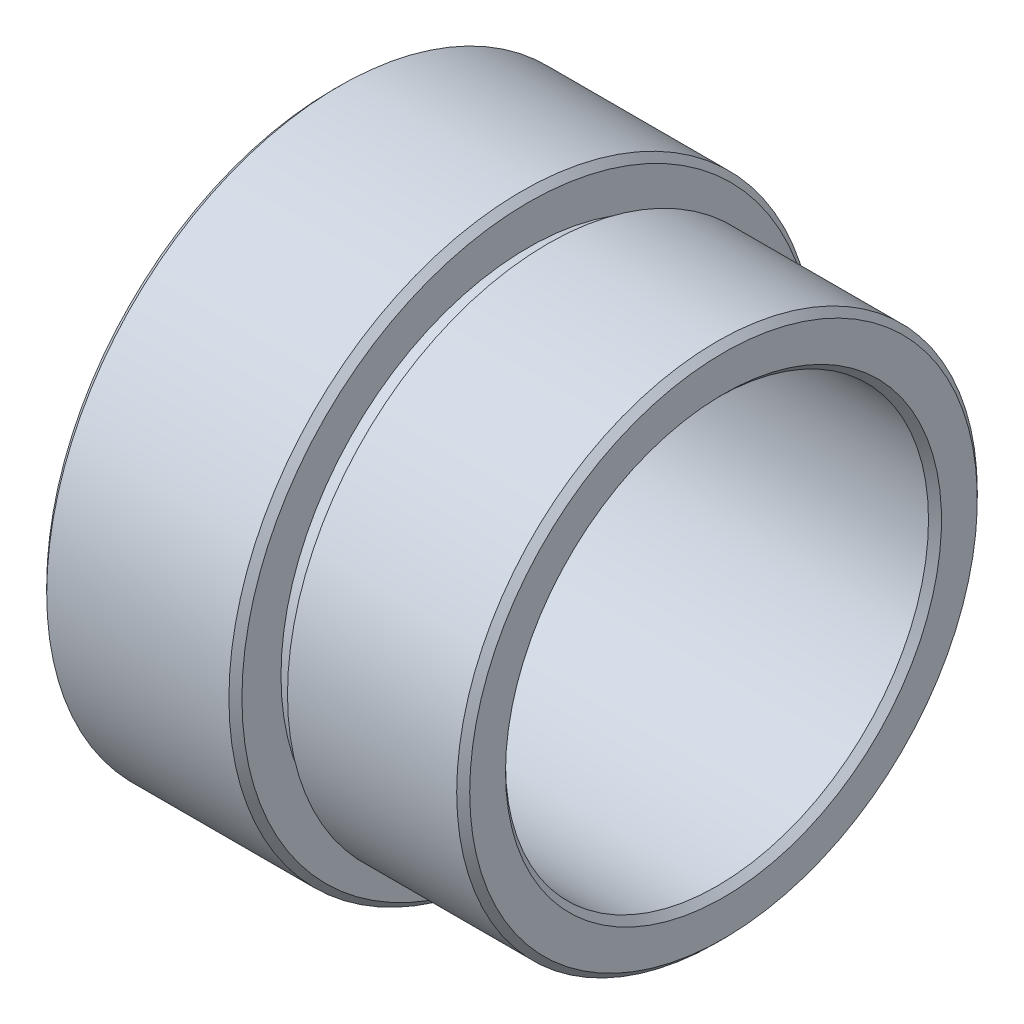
ISO-10303-21;
HEADER;
FILE_DESCRIPTION(('STEP AP214'),'2;1');
FILE_NAME('part.step','',(''),(''),'','','');
FILE_SCHEMA(('AUTOMOTIVE_DESIGN { 1 0 10303 214 1 1 1 1 }'));
ENDSEC;
DATA;
#1=APPLICATION_CONTEXT('core data for automotive mechanical design processes');
#2=APPLICATION_PROTOCOL_DEFINITION('international standard','automotive_design',2000,#1);
#3=PRODUCT_CONTEXT('',#1,'mechanical');
#4=PRODUCT('Part','Part','',(#3));
#5=PRODUCT_RELATED_PRODUCT_CATEGORY('part','',(#4));
#6=PRODUCT_DEFINITION_FORMATION('','',#4);
#7=PRODUCT_DEFINITION_CONTEXT('part definition',#1,'design');
#8=PRODUCT_DEFINITION('design','',#6,#7);
#9=PRODUCT_DEFINITION_SHAPE('','',#8);
#10=(LENGTH_UNIT() NAMED_UNIT(*) SI_UNIT(.MILLI.,.METRE.));
#11=(NAMED_UNIT(*) PLANE_ANGLE_UNIT() SI_UNIT($,.RADIAN.));
#12=(NAMED_UNIT(*) SI_UNIT($,.STERADIAN.) SOLID_ANGLE_UNIT());
#13=UNCERTAINTY_MEASURE_WITH_UNIT(LENGTH_MEASURE(1.E-05),#10,'distance_accuracy_value','');
#14=(GEOMETRIC_REPRESENTATION_CONTEXT(3) GLOBAL_UNCERTAINTY_ASSIGNED_CONTEXT((#13)) GLOBAL_UNIT_ASSIGNED_CONTEXT((#10,
#11,#12)) REPRESENTATION_CONTEXT('',''));
#15=CARTESIAN_POINT('',(0.,0.,0.));
#16=DIRECTION('',(0.,0.,1.));
#17=DIRECTION('',(1.,0.,0.));
#18=AXIS2_PLACEMENT_3D('',#15,#16,#17);
#19=CARTESIAN_POINT('',(0.,0.,0.));
#20=DIRECTION('',(-1.,0.,0.));
#21=DIRECTION('',(0.,0.,1.));
#22=AXIS2_PLACEMENT_3D('',#19,#20,#21);
#23=CYLINDRICAL_SURFACE('',#22,45.);
#24=CARTESIAN_POINT('',(12.9260815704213,2.22044604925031E-13,0.));
#25=DIRECTION('',(1.,0.,0.));
#26=DIRECTION('',(0.,0.,-1.));
#27=AXIS2_PLACEMENT_3D('',#24,#25,#26);
#28=CIRCLE('',#27,45.);
#29=CARTESIAN_POINT('',(12.9260815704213,2.22796566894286E-13,-45.));
#30=VERTEX_POINT('',#29);
#31=EDGE_CURVE('E44',#30,#30,#28,.T.);
#32=ORIENTED_EDGE('',*,*,#31,.T.);
#33=EDGE_LOOP('',(#32));
#34=FACE_BOUND('',#33,.T.);
#35=CARTESIAN_POINT('',(40.9260815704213,0.,0.));
#36=DIRECTION('',(-1.,0.,0.));
#37=DIRECTION('',(0.,0.,1.));
#38=AXIS2_PLACEMENT_3D('',#35,#36,#37);
#39=CIRCLE('',#38,45.);
#40=CARTESIAN_POINT('',(40.9260815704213,0.,45.));
#41=VERTEX_POINT('',#40);
#42=EDGE_CURVE('E49',#41,#41,#39,.T.);
#43=ORIENTED_EDGE('',*,*,#42,.T.);
#44=EDGE_LOOP('',(#43));
#45=FACE_BOUND('',#44,.T.);
#46=ADVANCED_FACE('F33',(#34,#45),#23,.T.);
#47=CARTESIAN_POINT('',(41.9260815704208,40.,0.));
#48=DIRECTION('',(-1.,0.,0.));
#49=DIRECTION('',(0.,0.,1.));
#50=AXIS2_PLACEMENT_3D('',#47,#48,#49);
#51=PLANE('',#50);
#52=CARTESIAN_POINT('',(41.9260815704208,0.,0.));
#53=DIRECTION('',(-1.,0.,0.));
#54=DIRECTION('',(0.,0.,1.));
#55=AXIS2_PLACEMENT_3D('',#52,#53,#54);
#56=CIRCLE('',#55,44.);
#57=CARTESIAN_POINT('',(41.9260815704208,0.,44.));
#58=VERTEX_POINT('',#57);
#59=EDGE_CURVE('E40',#58,#58,#56,.F.);
#60=ORIENTED_EDGE('',*,*,#59,.T.);
#61=EDGE_LOOP('',(#60));
#62=FACE_BOUND('',#61,.T.);
#63=CARTESIAN_POINT('',(41.9260815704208,0.,0.));
#64=DIRECTION('',(1.,0.,0.));
#65=DIRECTION('',(0.,0.,-1.));
#66=AXIS2_PLACEMENT_3D('',#63,#64,#65);
#67=CIRCLE('',#66,38.);
#68=CARTESIAN_POINT('',(41.9260815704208,0.,-38.));
#69=VERTEX_POINT('',#68);
#70=EDGE_CURVE('E73',#69,#69,#67,.T.);
#71=ORIENTED_EDGE('',*,*,#70,.F.);
#72=EDGE_LOOP('',(#71));
#73=FACE_BOUND('',#72,.T.);
#74=ADVANCED_FACE('F79',(#62,#73),#51,.F.);
#75=CARTESIAN_POINT('',(0.,0.,0.));
#76=DIRECTION('',(-1.,0.,0.));
#77=DIRECTION('',(0.,0.,1.));
#78=AXIS2_PLACEMENT_3D('',#75,#76,#77);
#79=CYLINDRICAL_SURFACE('',#78,40.);
#80=CARTESIAN_POINT('',(44.9260815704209,0.,0.));
#81=DIRECTION('',(1.,0.,0.));
#82=DIRECTION('',(0.,0.,-1.));
#83=AXIS2_PLACEMENT_3D('',#80,#81,#82);
#84=CIRCLE('',#83,40.);
#85=CARTESIAN_POINT('',(44.9260815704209,0.,-40.));
#86=VERTEX_POINT('',#85);
#87=EDGE_CURVE('E36',#86,#86,#84,.T.);
#88=ORIENTED_EDGE('',*,*,#87,.T.);
#89=EDGE_LOOP('',(#88));
#90=FACE_BOUND('',#89,.T.);
#91=CARTESIAN_POINT('',(70.9260815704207,0.,0.));
#92=DIRECTION('',(-1.,0.,0.));
#93=DIRECTION('',(0.,0.,1.));
#94=AXIS2_PLACEMENT_3D('',#91,#92,#93);
#95=CIRCLE('',#94,40.);
#96=CARTESIAN_POINT('',(70.9260815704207,0.,40.));
#97=VERTEX_POINT('',#96);
#98=EDGE_CURVE('E11',#97,#97,#95,.T.);
#99=ORIENTED_EDGE('',*,*,#98,.T.);
#100=EDGE_LOOP('',(#99));
#101=FACE_BOUND('',#100,.T.);
#102=ADVANCED_FACE('F81',(#90,#101),#79,.T.);
#103=CARTESIAN_POINT('',(71.926081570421,32.5000000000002,0.));
#104=DIRECTION('',(-1.,0.,0.));
#105=DIRECTION('',(0.,0.,1.));
#106=AXIS2_PLACEMENT_3D('',#103,#104,#105);
#107=PLANE('',#106);
#108=CARTESIAN_POINT('',(71.926081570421,0.,0.));
#109=DIRECTION('',(-1.,0.,0.));
#110=DIRECTION('',(0.,0.,1.));
#111=AXIS2_PLACEMENT_3D('',#108,#109,#110);
#112=CIRCLE('',#111,33.5);
#113=CARTESIAN_POINT('',(71.926081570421,0.,33.5));
#114=VERTEX_POINT('',#113);
#115=EDGE_CURVE('E52',#114,#114,#112,.T.);
#116=ORIENTED_EDGE('',*,*,#115,.T.);
#117=EDGE_LOOP('',(#116));
#118=FACE_BOUND('',#117,.T.);
#119=CARTESIAN_POINT('',(71.926081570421,0.,0.));
#120=DIRECTION('',(-1.,0.,0.));
#121=DIRECTION('',(0.,0.,1.));
#122=AXIS2_PLACEMENT_3D('',#119,#120,#121);
#123=CIRCLE('',#122,39.);
#124=CARTESIAN_POINT('',(71.926081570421,0.,39.));
#125=VERTEX_POINT('',#124);
#126=EDGE_CURVE('E55',#125,#125,#123,.F.);
#127=ORIENTED_EDGE('',*,*,#126,.T.);
#128=EDGE_LOOP('',(#127));
#129=FACE_BOUND('',#128,.T.);
#130=ADVANCED_FACE('F87',(#118,#129),#107,.F.);
#131=CARTESIAN_POINT('',(0.,0.,0.));
#132=DIRECTION('',(-1.,0.,0.));
#133=DIRECTION('',(0.,0.,1.));
#134=AXIS2_PLACEMENT_3D('',#131,#132,#133);
#135=CYLINDRICAL_SURFACE('',#134,32.5);
#136=CARTESIAN_POINT('',(12.9260815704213,2.22044604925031E-13,0.));
#137=DIRECTION('',(1.,0.,0.));
#138=DIRECTION('',(0.,0.,-1.));
#139=AXIS2_PLACEMENT_3D('',#136,#137,#138);
#140=CIRCLE('',#139,32.5);
#141=CARTESIAN_POINT('',(12.9260815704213,2.22587688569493E-13,-32.5));
#142=VERTEX_POINT('',#141);
#143=EDGE_CURVE('E64',#142,#142,#140,.F.);
#144=ORIENTED_EDGE('',*,*,#143,.T.);
#145=EDGE_LOOP('',(#144));
#146=FACE_BOUND('',#145,.T.);
#147=CARTESIAN_POINT('',(70.9260815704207,0.,0.));
#148=DIRECTION('',(-1.,0.,0.));
#149=DIRECTION('',(0.,0.,1.));
#150=AXIS2_PLACEMENT_3D('',#147,#148,#149);
#151=CIRCLE('',#150,32.5);
#152=CARTESIAN_POINT('',(70.9260815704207,0.,32.5));
#153=VERTEX_POINT('',#152);
#154=EDGE_CURVE('E67',#153,#153,#151,.F.);
#155=ORIENTED_EDGE('',*,*,#154,.T.);
#156=EDGE_LOOP('',(#155));
#157=FACE_BOUND('',#156,.T.);
#158=ADVANCED_FACE('F94',(#146,#157),#135,.F.);
#159=CARTESIAN_POINT('',(11.926081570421,44.9999999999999,0.));
#160=DIRECTION('',(1.,0.,0.));
#161=DIRECTION('',(0.,0.,-1.));
#162=AXIS2_PLACEMENT_3D('',#159,#160,#161);
#163=PLANE('',#162);
#164=CARTESIAN_POINT('',(11.926081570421,0.,0.));
#165=DIRECTION('',(1.,0.,0.));
#166=DIRECTION('',(0.,0.,-1.));
#167=AXIS2_PLACEMENT_3D('',#164,#165,#166);
#168=CIRCLE('',#167,33.5);
#169=CARTESIAN_POINT('',(11.926081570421,0.,-33.5));
#170=VERTEX_POINT('',#169);
#171=EDGE_CURVE('E58',#170,#170,#168,.T.);
#172=ORIENTED_EDGE('',*,*,#171,.T.);
#173=EDGE_LOOP('',(#172));
#174=FACE_BOUND('',#173,.T.);
#175=CARTESIAN_POINT('',(11.926081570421,0.,0.));
#176=DIRECTION('',(1.,0.,0.));
#177=DIRECTION('',(0.,0.,-1.));
#178=AXIS2_PLACEMENT_3D('',#175,#176,#177);
#179=CIRCLE('',#178,44.);
#180=CARTESIAN_POINT('',(11.926081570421,0.,-44.));
#181=VERTEX_POINT('',#180);
#182=EDGE_CURVE('E61',#181,#181,#179,.F.);
#183=ORIENTED_EDGE('',*,*,#182,.T.);
#184=EDGE_LOOP('',(#183));
#185=FACE_BOUND('',#184,.T.);
#186=ADVANCED_FACE('F98',(#174,#185),#163,.F.);
#187=CARTESIAN_POINT('',(12.9260815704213,2.22044604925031E-13,0.));
#188=DIRECTION('',(-1.,0.,0.));
#189=DIRECTION('',(0.,0.,1.));
#190=AXIS2_PLACEMENT_3D('',#187,#188,#189);
#191=CONICAL_SURFACE('',#190,32.5,0.785398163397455);
#192=ORIENTED_EDGE('',*,*,#171,.F.);
#193=EDGE_LOOP('',(#192));
#194=FACE_BOUND('',#193,.T.);
#195=ORIENTED_EDGE('',*,*,#143,.F.);
#196=EDGE_LOOP('',(#195));
#197=FACE_BOUND('',#196,.T.);
#198=ADVANCED_FACE('F102',(#194,#197),#191,.F.);
#199=CARTESIAN_POINT('',(71.926081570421,0.,0.));
#200=DIRECTION('',(1.,0.,0.));
#201=DIRECTION('',(0.,0.,-1.));
#202=AXIS2_PLACEMENT_3D('',#199,#200,#201);
#203=CONICAL_SURFACE('',#202,33.5,0.785398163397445);
#204=ORIENTED_EDGE('',*,*,#154,.F.);
#205=EDGE_LOOP('',(#204));
#206=FACE_BOUND('',#205,.T.);
#207=ORIENTED_EDGE('',*,*,#115,.F.);
#208=EDGE_LOOP('',(#207));
#209=FACE_BOUND('',#208,.T.);
#210=ADVANCED_FACE('F106',(#206,#209),#203,.F.);
#211=CARTESIAN_POINT('',(11.926081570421,0.,0.));
#212=DIRECTION('',(1.,0.,0.));
#213=DIRECTION('',(0.,0.,-1.));
#214=AXIS2_PLACEMENT_3D('',#211,#212,#213);
#215=CONICAL_SURFACE('',#214,44.,0.785398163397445);
#216=ORIENTED_EDGE('',*,*,#31,.F.);
#217=EDGE_LOOP('',(#216));
#218=FACE_BOUND('',#217,.T.);
#219=ORIENTED_EDGE('',*,*,#182,.F.);
#220=EDGE_LOOP('',(#219));
#221=FACE_BOUND('',#220,.T.);
#222=ADVANCED_FACE('F110',(#218,#221),#215,.T.);
#223=CARTESIAN_POINT('',(40.9260815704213,0.,0.));
#224=DIRECTION('',(-1.,0.,0.));
#225=DIRECTION('',(0.,0.,1.));
#226=AXIS2_PLACEMENT_3D('',#223,#224,#225);
#227=CONICAL_SURFACE('',#226,45.,0.785398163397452);
#228=ORIENTED_EDGE('',*,*,#59,.F.);
#229=EDGE_LOOP('',(#228));
#230=FACE_BOUND('',#229,.T.);
#231=ORIENTED_EDGE('',*,*,#42,.F.);
#232=EDGE_LOOP('',(#231));
#233=FACE_BOUND('',#232,.T.);
#234=ADVANCED_FACE('F114',(#230,#233),#227,.T.);
#235=CARTESIAN_POINT('',(70.9260815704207,0.,0.));
#236=DIRECTION('',(-1.,0.,0.));
#237=DIRECTION('',(0.,0.,1.));
#238=AXIS2_PLACEMENT_3D('',#235,#236,#237);
#239=CONICAL_SURFACE('',#238,40.,0.785398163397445);
#240=ORIENTED_EDGE('',*,*,#126,.F.);
#241=EDGE_LOOP('',(#240));
#242=FACE_BOUND('',#241,.T.);
#243=ORIENTED_EDGE('',*,*,#98,.F.);
#244=EDGE_LOOP('',(#243));
#245=FACE_BOUND('',#244,.T.);
#246=ADVANCED_FACE('F118',(#242,#245),#239,.T.);
#247=CARTESIAN_POINT('',(44.9260815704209,0.,0.));
#248=DIRECTION('',(1.,0.,0.));
#249=DIRECTION('',(0.,0.,-1.));
#250=AXIS2_PLACEMENT_3D('',#247,#248,#249);
#251=PLANE('',#250);
#252=CARTESIAN_POINT('',(44.9260815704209,0.,0.));
#253=DIRECTION('',(1.,0.,0.));
#254=DIRECTION('',(0.,0.,-1.));
#255=AXIS2_PLACEMENT_3D('',#252,#253,#254);
#256=CIRCLE('',#255,38.);
#257=CARTESIAN_POINT('',(44.9260815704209,0.,-38.));
#258=VERTEX_POINT('',#257);
#259=EDGE_CURVE('E70',#258,#258,#256,.T.);
#260=ORIENTED_EDGE('',*,*,#259,.T.);
#261=EDGE_LOOP('',(#260));
#262=FACE_BOUND('',#261,.T.);
#263=ORIENTED_EDGE('',*,*,#87,.F.);
#264=EDGE_LOOP('',(#263));
#265=FACE_BOUND('',#264,.T.);
#266=ADVANCED_FACE('F122',(#262,#265),#251,.F.);
#267=CARTESIAN_POINT('',(44.9260815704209,0.,0.));
#268=DIRECTION('',(-1.,0.,0.));
#269=DIRECTION('',(0.,0.,1.));
#270=AXIS2_PLACEMENT_3D('',#267,#268,#269);
#271=CYLINDRICAL_SURFACE('',#270,38.);
#272=ORIENTED_EDGE('',*,*,#259,.F.);
#273=EDGE_LOOP('',(#272));
#274=FACE_BOUND('',#273,.T.);
#275=ORIENTED_EDGE('',*,*,#70,.T.);
#276=EDGE_LOOP('',(#275));
#277=FACE_BOUND('',#276,.T.);
#278=ADVANCED_FACE('F77',(#274,#277),#271,.T.);
#279=CLOSED_SHELL('',(#46,#74,#102,#130,#158,#186,#198,#210,#222,#234,#246,#266,#278));
#280=MANIFOLD_SOLID_BREP('B2',#279);
#281=ADVANCED_BREP_SHAPE_REPRESENTATION('',(#18,#280),#14);
#282=SHAPE_DEFINITION_REPRESENTATION(#9,#281);
ENDSEC;
END-ISO-10303-21;
